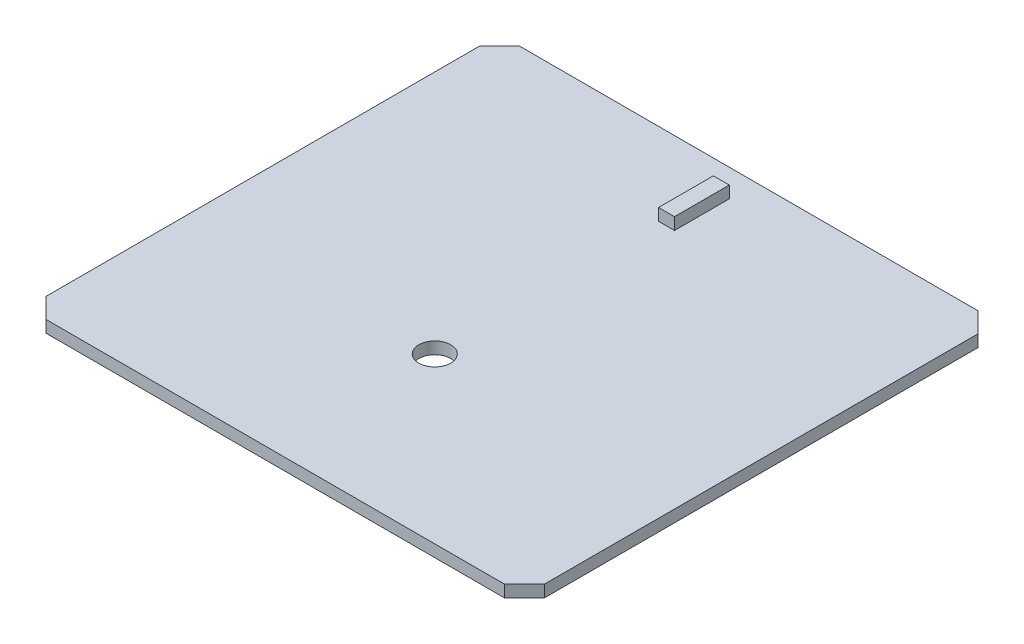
from build123d import *

# Parameters (mm, degrees)
SKETCH_1_R      = 1.6
EXTRUDE_1_DEPTH = 1.2
SKETCH_2_W      = 1.6
SKETCH_2_H      = 5.5
EXTRUDE_2_DEPTH = 1.2
SKETCH_3_W      = 7
SKETCH_3_H      = 4.5
EXTRUDE_3_DEPTH = 3


with BuildPart() as part:
    # Sketch 1 → Extrude 1 (new body)
    with BuildSketch(Plane(origin=(0, 0, 0), x_dir=(1, 0, 0), z_dir=(0, 1, 0))):
        Polygon((-23, 23.75), (-25, 21.75), (-25, -21.75), (-23, -23.75), (23, -23.75), (25, -21.75), (25, 21.75), (23, 23.75), align=None)
        with Locations(Location((-0.5, -7.25, 0), (0, 0, 270))):
            Circle(SKETCH_1_R, mode=Mode.SUBTRACT)
    extrude(amount=EXTRUDE_1_DEPTH)

    # Sketch 2 → Extrude 2 (add)
    with BuildSketch(Plane(origin=(0, 1.2, 0), x_dir=(1, 0, 0), z_dir=(0, 1, 0))):
        with Locations((0, 18.25)):
            Rectangle(SKETCH_2_W, SKETCH_2_H)
    extrude(amount=EXTRUDE_2_DEPTH)

    # Sketch 3 → Extrude 3 (add)
    with BuildSketch(Plane(origin=(0, 0, 0), x_dir=(-1, 0, 0), z_dir=(0, -1, 0))):
        with Locations((12, -11.25)):
            Rectangle(SKETCH_3_W, SKETCH_3_H)
    extrude(amount=EXTRUDE_3_DEPTH)


solid = part.part
